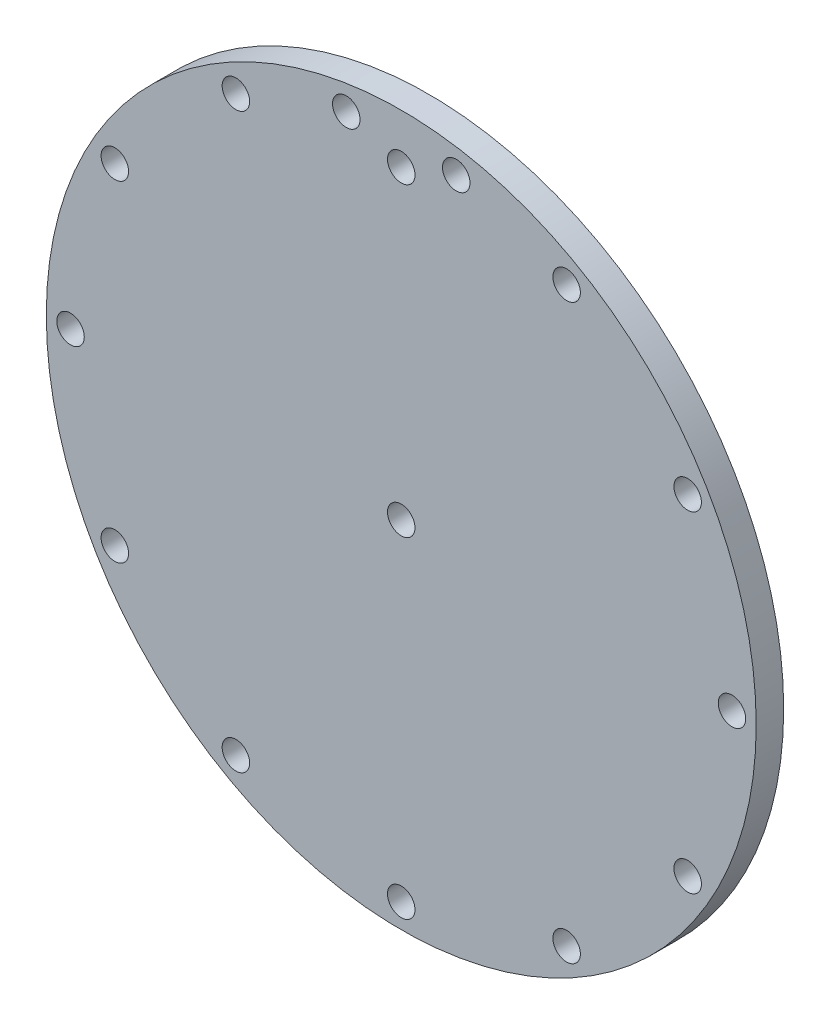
from build123d import *

# Parameters (mm, degrees)
SKETCH2_R           = 41
SKETCH2_R_2         = 1.5875
BOSS_EXTRUDE1_DEPTH = 3.175


with BuildPart() as part:
    # Sketch2 → Boss-Extrude1 (new body)
    with BuildSketch(Plane.XY):
        Circle(SKETCH2_R)
        Circle(SKETCH2_R_2, mode=Mode.SUBTRACT)
        with Locations((-38.2, 0)):
            Circle(SKETCH2_R_2, mode=Mode.SUBTRACT)
        with Locations((-33.082170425, -19.1)):
            Circle(SKETCH2_R_2, mode=Mode.SUBTRACT)
        with Locations((-19.1, -33.082170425)):
            Circle(SKETCH2_R_2, mode=Mode.SUBTRACT)
        with Locations((0, -38.2)):
            Circle(SKETCH2_R_2, mode=Mode.SUBTRACT)
        with Locations((19.1, -33.082170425)):
            Circle(SKETCH2_R_2, mode=Mode.SUBTRACT)
        with Locations((33.082170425, -19.1)):
            Circle(SKETCH2_R_2, mode=Mode.SUBTRACT)
        with Locations((38.2, 0)):
            Circle(SKETCH2_R_2, mode=Mode.SUBTRACT)
        with Locations((-33.082170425, 19.1)):
            Circle(SKETCH2_R_2, mode=Mode.SUBTRACT)
        with Locations((-19.1, 33.082170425)):
            Circle(SKETCH2_R_2, mode=Mode.SUBTRACT)
        with Locations((33.082170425, 19.1)):
            Circle(SKETCH2_R_2, mode=Mode.SUBTRACT)
        with Locations((19.1, 33.082170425)):
            Circle(SKETCH2_R_2, mode=Mode.SUBTRACT)
        with Locations((6.35, 37.668521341)):
            Circle(SKETCH2_R_2, mode=Mode.SUBTRACT)
        with Locations((-6.35, 37.668521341)):
            Circle(SKETCH2_R_2, mode=Mode.SUBTRACT)
        with Locations((0, 35.292411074)):
            Circle(SKETCH2_R_2, mode=Mode.SUBTRACT)
    extrude(amount=BOSS_EXTRUDE1_DEPTH)


solid = part.part
